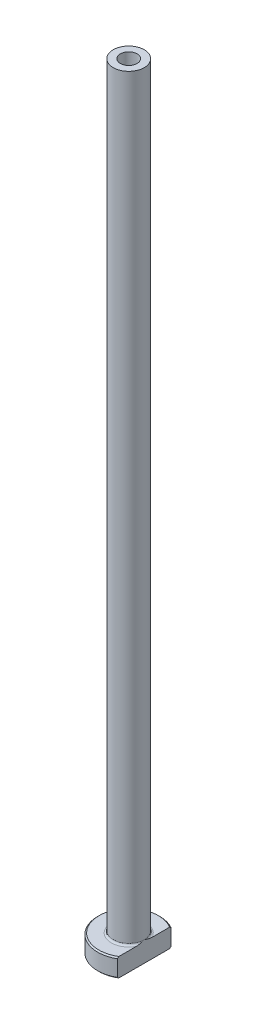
ISO-10303-21;
HEADER;
FILE_DESCRIPTION(('STEP AP214'),'2;1');
FILE_NAME('part.step','',(''),(''),'','','');
FILE_SCHEMA(('AUTOMOTIVE_DESIGN { 1 0 10303 214 1 1 1 1 }'));
ENDSEC;
DATA;
#1=APPLICATION_CONTEXT('core data for automotive mechanical design processes');
#2=APPLICATION_PROTOCOL_DEFINITION('international standard','automotive_design',2000,#1);
#3=PRODUCT_CONTEXT('',#1,'mechanical');
#4=PRODUCT('Part','Part','',(#3));
#5=PRODUCT_RELATED_PRODUCT_CATEGORY('part','',(#4));
#6=PRODUCT_DEFINITION_FORMATION('','',#4);
#7=PRODUCT_DEFINITION_CONTEXT('part definition',#1,'design');
#8=PRODUCT_DEFINITION('design','',#6,#7);
#9=PRODUCT_DEFINITION_SHAPE('','',#8);
#10=(LENGTH_UNIT() NAMED_UNIT(*) SI_UNIT(.MILLI.,.METRE.));
#11=(NAMED_UNIT(*) PLANE_ANGLE_UNIT() SI_UNIT($,.RADIAN.));
#12=(NAMED_UNIT(*) SI_UNIT($,.STERADIAN.) SOLID_ANGLE_UNIT());
#13=UNCERTAINTY_MEASURE_WITH_UNIT(LENGTH_MEASURE(1.E-05),#10,'distance_accuracy_value','');
#14=(GEOMETRIC_REPRESENTATION_CONTEXT(3) GLOBAL_UNCERTAINTY_ASSIGNED_CONTEXT((#13)) GLOBAL_UNIT_ASSIGNED_CONTEXT((#10,
#11,#12)) REPRESENTATION_CONTEXT('',''));
#15=CARTESIAN_POINT('',(0.,0.,0.));
#16=DIRECTION('',(0.,0.,1.));
#17=DIRECTION('',(1.,0.,0.));
#18=AXIS2_PLACEMENT_3D('',#15,#16,#17);
#19=CARTESIAN_POINT('',(0.,92.1876809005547,0.));
#20=DIRECTION('',(0.,1.,0.));
#21=DIRECTION('',(0.,0.,1.));
#22=AXIS2_PLACEMENT_3D('',#19,#20,#21);
#23=CYLINDRICAL_SURFACE('',#22,1.35);
#24=CARTESIAN_POINT('',(0.,125.,0.));
#25=DIRECTION('',(0.,1.,0.));
#26=DIRECTION('',(0.,0.,1.));
#27=AXIS2_PLACEMENT_3D('',#24,#25,#26);
#28=CIRCLE('',#27,1.35);
#29=CARTESIAN_POINT('',(0.,125.,1.35));
#30=VERTEX_POINT('',#29);
#31=EDGE_CURVE('E167',#30,#30,#28,.T.);
#32=ORIENTED_EDGE('',*,*,#31,.T.);
#33=EDGE_LOOP('',(#32));
#34=FACE_BOUND('',#33,.T.);
#35=CARTESIAN_POINT('',(0.,80.,0.));
#36=DIRECTION('',(0.,1.,0.));
#37=DIRECTION('',(0.,0.,1.));
#38=AXIS2_PLACEMENT_3D('',#35,#36,#37);
#39=CIRCLE('',#38,1.35);
#40=CARTESIAN_POINT('',(0.,80.,1.35));
#41=VERTEX_POINT('',#40);
#42=EDGE_CURVE('E170',#41,#41,#39,.T.);
#43=ORIENTED_EDGE('',*,*,#42,.F.);
#44=EDGE_LOOP('',(#43));
#45=FACE_BOUND('',#44,.T.);
#46=ADVANCED_FACE('F32',(#34,#45),#23,.F.);
#47=CARTESIAN_POINT('',(-1.35,125.,0.));
#48=DIRECTION('',(0.,1.,0.));
#49=DIRECTION('',(0.,0.,1.));
#50=AXIS2_PLACEMENT_3D('',#47,#48,#49);
#51=PLANE('',#50);
#52=CARTESIAN_POINT('',(0.,125.,0.));
#53=DIRECTION('',(0.,1.,0.));
#54=DIRECTION('',(0.,0.,1.));
#55=AXIS2_PLACEMENT_3D('',#52,#53,#54);
#56=CIRCLE('',#55,2.5);
#57=CARTESIAN_POINT('',(0.,125.,2.5));
#58=VERTEX_POINT('',#57);
#59=EDGE_CURVE('E174',#58,#58,#56,.T.);
#60=ORIENTED_EDGE('',*,*,#59,.T.);
#61=EDGE_LOOP('',(#60));
#62=FACE_BOUND('',#61,.T.);
#63=ORIENTED_EDGE('',*,*,#31,.F.);
#64=EDGE_LOOP('',(#63));
#65=FACE_BOUND('',#64,.T.);
#66=ADVANCED_FACE('F157',(#62,#65),#51,.T.);
#67=CARTESIAN_POINT('',(0.,92.1876809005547,0.));
#68=DIRECTION('',(0.,1.,0.));
#69=DIRECTION('',(0.,0.,1.));
#70=AXIS2_PLACEMENT_3D('',#67,#68,#69);
#71=CYLINDRICAL_SURFACE('',#70,2.5);
#72=CARTESIAN_POINT('',(0.,3.3,0.));
#73=DIRECTION('',(0.,1.,0.));
#74=DIRECTION('',(0.,0.,1.));
#75=AXIS2_PLACEMENT_3D('',#72,#73,#74);
#76=CIRCLE('',#75,2.5);
#77=CARTESIAN_POINT('',(2.5,3.3,0.));
#78=VERTEX_POINT('',#77);
#79=EDGE_CURVE('E180',#78,#78,#76,.T.);
#80=ORIENTED_EDGE('',*,*,#79,.T.);
#81=EDGE_LOOP('',(#80));
#82=FACE_BOUND('',#81,.T.);
#83=ORIENTED_EDGE('',*,*,#59,.F.);
#84=EDGE_LOOP('',(#83));
#85=FACE_BOUND('',#84,.T.);
#86=ADVANCED_FACE('F162',(#82,#85),#71,.T.);
#87=CARTESIAN_POINT('',(-2.49999999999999,3.,0.));
#88=DIRECTION('',(0.,1.,0.));
#89=DIRECTION('',(0.,0.,1.));
#90=AXIS2_PLACEMENT_3D('',#87,#88,#89);
#91=PLANE('',#90);
#92=DIRECTION('',(0.,0.,1.));
#93=VECTOR('',#92,1.);
#94=CARTESIAN_POINT('',(2.49999999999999,3.,0.));
#95=LINE('',#94,#93);
#96=CARTESIAN_POINT('',(2.5,3.,-4.0975602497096));
#97=VERTEX_POINT('',#96);
#98=CARTESIAN_POINT('',(2.49999999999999,3.,-1.26095202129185));
#99=VERTEX_POINT('',#98);
#100=EDGE_CURVE('E54',#97,#99,#95,.T.);
#101=ORIENTED_EDGE('',*,*,#100,.F.);
#102=CARTESIAN_POINT('',(0.,3.,0.));
#103=DIRECTION('',(0.,1.,0.));
#104=DIRECTION('',(0.,0.,1.));
#105=AXIS2_PLACEMENT_3D('',#102,#103,#104);
#106=CIRCLE('',#105,4.80000000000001);
#107=CARTESIAN_POINT('',(2.49999999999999,3.,4.0975602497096));
#108=VERTEX_POINT('',#107);
#109=EDGE_CURVE('E186',#97,#108,#106,.T.);
#110=ORIENTED_EDGE('',*,*,#109,.T.);
#111=CARTESIAN_POINT('',(2.49999999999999,3.,1.26095202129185));
#112=VERTEX_POINT('',#111);
#113=EDGE_CURVE('E134',#112,#108,#95,.T.);
#114=ORIENTED_EDGE('',*,*,#113,.F.);
#115=CARTESIAN_POINT('',(0.,3.,0.));
#116=DIRECTION('',(0.,1.,0.));
#117=DIRECTION('',(0.,0.,1.));
#118=AXIS2_PLACEMENT_3D('',#115,#116,#117);
#119=CIRCLE('',#118,2.8);
#120=EDGE_CURVE('E183',#112,#99,#119,.F.);
#121=ORIENTED_EDGE('',*,*,#120,.T.);
#122=EDGE_LOOP('',(#101,#110,#114,#121));
#123=FACE_BOUND('',#122,.T.);
#124=ADVANCED_FACE('F197',(#123),#91,.T.);
#125=CARTESIAN_POINT('',(0.,92.1876809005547,0.));
#126=DIRECTION('',(0.,1.,0.));
#127=DIRECTION('',(0.,0.,1.));
#128=AXIS2_PLACEMENT_3D('',#125,#126,#127);
#129=CYLINDRICAL_SURFACE('',#128,4.99999999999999);
#130=DIRECTION('',(0.,-1.,0.));
#131=VECTOR('',#130,1.);
#132=CARTESIAN_POINT('',(2.49999999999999,125.,4.33012701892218));
#133=LINE('',#132,#131);
#134=CARTESIAN_POINT('',(2.49999999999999,2.80000000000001,4.33012701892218));
#135=VERTEX_POINT('',#134);
#136=CARTESIAN_POINT('',(2.49999999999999,0.200000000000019,4.33012701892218));
#137=VERTEX_POINT('',#136);
#138=EDGE_CURVE('E82',#135,#137,#133,.T.);
#139=ORIENTED_EDGE('',*,*,#138,.F.);
#140=CARTESIAN_POINT('',(0.,2.80000000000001,0.));
#141=DIRECTION('',(0.,1.,0.));
#142=DIRECTION('',(0.,0.,1.));
#143=AXIS2_PLACEMENT_3D('',#140,#141,#142);
#144=CIRCLE('',#143,4.99999999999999);
#145=CARTESIAN_POINT('',(2.5,2.80000000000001,-4.33012701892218));
#146=VERTEX_POINT('',#145);
#147=EDGE_CURVE('E95',#135,#146,#144,.F.);
#148=ORIENTED_EDGE('',*,*,#147,.T.);
#149=DIRECTION('',(0.,-1.,0.));
#150=VECTOR('',#149,1.);
#151=CARTESIAN_POINT('',(2.5,125.,-4.33012701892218));
#152=LINE('',#151,#150);
#153=CARTESIAN_POINT('',(2.5,0.20000000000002,-4.33012701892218));
#154=VERTEX_POINT('',#153);
#155=EDGE_CURVE('E192',#146,#154,#152,.T.);
#156=ORIENTED_EDGE('',*,*,#155,.T.);
#157=CARTESIAN_POINT('',(0.,0.20000000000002,0.));
#158=DIRECTION('',(0.,-1.,0.));
#159=DIRECTION('',(0.,0.,-1.));
#160=AXIS2_PLACEMENT_3D('',#157,#158,#159);
#161=CIRCLE('',#160,4.99999999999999);
#162=EDGE_CURVE('E98',#154,#137,#161,.F.);
#163=ORIENTED_EDGE('',*,*,#162,.T.);
#164=EDGE_LOOP('',(#139,#148,#156,#163));
#165=FACE_BOUND('',#164,.T.);
#166=ADVANCED_FACE('F190',(#165),#129,.T.);
#167=CARTESIAN_POINT('',(-4.99999999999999,0.,0.));
#168=DIRECTION('',(0.,-1.,0.));
#169=DIRECTION('',(0.,0.,-1.));
#170=AXIS2_PLACEMENT_3D('',#167,#168,#169);
#171=PLANE('',#170);
#172=CARTESIAN_POINT('',(0.,0.,0.));
#173=DIRECTION('',(0.,-1.,0.));
#174=DIRECTION('',(0.,0.,-1.));
#175=AXIS2_PLACEMENT_3D('',#172,#173,#174);
#176=CIRCLE('',#175,2.09999999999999);
#177=CARTESIAN_POINT('',(0.,0.,-2.09999999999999));
#178=VERTEX_POINT('',#177);
#179=EDGE_CURVE('E40',#178,#178,#176,.F.);
#180=ORIENTED_EDGE('',*,*,#179,.T.);
#181=EDGE_LOOP('',(#180));
#182=FACE_BOUND('',#181,.T.);
#183=DIRECTION('',(0.,0.,-1.));
#184=VECTOR('',#183,1.);
#185=CARTESIAN_POINT('',(2.49999999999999,0.,4.33012701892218));
#186=LINE('',#185,#184);
#187=CARTESIAN_POINT('',(2.49999999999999,0.,4.09756024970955));
#188=VERTEX_POINT('',#187);
#189=CARTESIAN_POINT('',(2.5,0.,-4.09756024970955));
#190=VERTEX_POINT('',#189);
#191=EDGE_CURVE('E47',#188,#190,#186,.T.);
#192=ORIENTED_EDGE('',*,*,#191,.F.);
#193=CARTESIAN_POINT('',(0.,0.,0.));
#194=DIRECTION('',(0.,-1.,0.));
#195=DIRECTION('',(0.,0.,-1.));
#196=AXIS2_PLACEMENT_3D('',#193,#194,#195);
#197=CIRCLE('',#196,4.79999999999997);
#198=EDGE_CURVE('E92',#188,#190,#197,.T.);
#199=ORIENTED_EDGE('',*,*,#198,.T.);
#200=EDGE_LOOP('',(#192,#199));
#201=FACE_BOUND('',#200,.T.);
#202=ADVANCED_FACE('F91',(#182,#201),#171,.T.);
#203=CARTESIAN_POINT('',(0.,92.1876809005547,0.));
#204=DIRECTION('',(0.,1.,0.));
#205=DIRECTION('',(0.,0.,1.));
#206=AXIS2_PLACEMENT_3D('',#203,#204,#205);
#207=CYLINDRICAL_SURFACE('',#206,1.59999999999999);
#208=CARTESIAN_POINT('',(0.,0.499999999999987,0.));
#209=DIRECTION('',(0.,-1.,0.));
#210=DIRECTION('',(0.,0.,-1.));
#211=AXIS2_PLACEMENT_3D('',#208,#209,#210);
#212=CIRCLE('',#211,1.59999999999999);
#213=CARTESIAN_POINT('',(0.,0.499999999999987,-1.59999999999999));
#214=VERTEX_POINT('',#213);
#215=EDGE_CURVE('E11',#214,#214,#212,.T.);
#216=ORIENTED_EDGE('',*,*,#215,.T.);
#217=EDGE_LOOP('',(#216));
#218=FACE_BOUND('',#217,.T.);
#219=CARTESIAN_POINT('',(0.,68.,0.));
#220=DIRECTION('',(0.,1.,0.));
#221=DIRECTION('',(0.,0.,1.));
#222=AXIS2_PLACEMENT_3D('',#219,#220,#221);
#223=CIRCLE('',#222,1.6);
#224=CARTESIAN_POINT('',(0.,68.,1.6));
#225=VERTEX_POINT('',#224);
#226=EDGE_CURVE('E172',#225,#225,#223,.T.);
#227=ORIENTED_EDGE('',*,*,#226,.T.);
#228=EDGE_LOOP('',(#227));
#229=FACE_BOUND('',#228,.T.);
#230=ADVANCED_FACE('F215',(#218,#229),#207,.F.);
#231=CARTESIAN_POINT('',(0.,68.,0.));
#232=DIRECTION('',(0.,-1.,0.));
#233=DIRECTION('',(0.,0.,-1.));
#234=AXIS2_PLACEMENT_3D('',#231,#232,#233);
#235=CONICAL_SURFACE('',#234,1.6,0.0208303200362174);
#236=ORIENTED_EDGE('',*,*,#42,.T.);
#237=EDGE_LOOP('',(#236));
#238=FACE_BOUND('',#237,.T.);
#239=ORIENTED_EDGE('',*,*,#226,.F.);
#240=EDGE_LOOP('',(#239));
#241=FACE_BOUND('',#240,.T.);
#242=ADVANCED_FACE('F111',(#238,#241),#235,.F.);
#243=CARTESIAN_POINT('',(0.,3.3,0.));
#244=DIRECTION('',(0.,1.,0.));
#245=DIRECTION('',(0.,0.,1.));
#246=AXIS2_PLACEMENT_3D('',#243,#244,#245);
#247=TOROIDAL_SURFACE('',#246,2.8,0.3);
#248=ORIENTED_EDGE('',*,*,#120,.F.);
#249=CARTESIAN_POINT('',(2.5,3.3,0.));
#250=CARTESIAN_POINT('',(2.5,3.3000006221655,-4.84263612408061E-11));
#251=CARTESIAN_POINT('',(2.5,3.30000124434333,1.59620985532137E-07));
#252=CARTESIAN_POINT('',(2.5,3.30000243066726,6.45477798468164E-07));
#253=CARTESIAN_POINT('',(2.5,3.30000299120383,9.78480493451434E-07));
#254=CARTESIAN_POINT('',(2.5,3.30000411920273,1.77471950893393E-06));
#255=CARTESIAN_POINT('',(2.5,3.30000467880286,2.24902109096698E-06));
#256=CARTESIAN_POINT('',(2.5,3.30000572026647,3.25953640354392E-06));
#257=CARTESIAN_POINT('',(2.5,3.30000620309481,3.79480702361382E-06));
#258=CARTESIAN_POINT('',(2.5,3.30000787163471,5.75794575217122E-06));
#259=CARTESIAN_POINT('',(2.5,3.30000896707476,7.26424053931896E-06));
#260=CARTESIAN_POINT('',(2.5,3.30001087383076,1.03361123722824E-05));
#261=CARTESIAN_POINT('',(2.5,3.30001169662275,1.18949493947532E-05));
#262=CARTESIAN_POINT('',(2.5,3.30001489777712,1.81400843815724E-05));
#263=CARTESIAN_POINT('',(2.5,3.30001712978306,2.29062168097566E-05));
#264=CARTESIAN_POINT('',(2.5,3.30002067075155,3.21793855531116E-05));
#265=CARTESIAN_POINT('',(2.5,3.30002205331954,3.66588977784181E-05));
#266=CARTESIAN_POINT('',(2.5,3.30002810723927,5.61718387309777E-05));
#267=CARTESIAN_POINT('',(2.5,3.30003284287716,7.11735842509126E-05));
#268=CARTESIAN_POINT('',(2.5,3.30004025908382,9.89920300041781E-05));
#269=CARTESIAN_POINT('',(2.5,3.30004315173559,0.000111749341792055));
#270=CARTESIAN_POINT('',(2.5,3.30006652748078,0.000206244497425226));
#271=CARTESIAN_POINT('',(2.5,3.3000969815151,0.000285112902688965));
#272=CARTESIAN_POINT('',(2.49999999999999,3.3002121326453,0.000594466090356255));
#273=CARTESIAN_POINT('',(2.5,3.30028938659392,0.000826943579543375));
#274=CARTESIAN_POINT('',(2.5,3.30059681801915,0.00173885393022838));
#275=CARTESIAN_POINT('',(2.5,3.30083479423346,0.00241625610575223));
#276=CARTESIAN_POINT('',(2.49999999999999,3.30181198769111,0.00521069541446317));
#277=CARTESIAN_POINT('',(2.49999999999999,3.30254240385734,0.00732996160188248));
#278=CARTESIAN_POINT('',(2.5,3.3122604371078,0.0355096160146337));
#279=CARTESIAN_POINT('',(2.5,3.32130808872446,0.0615551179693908));
#280=CARTESIAN_POINT('',(2.49999999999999,3.33896212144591,0.112677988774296));
#281=CARTESIAN_POINT('',(2.49999999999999,3.3475721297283,0.137754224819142));
#282=CARTESIAN_POINT('',(2.5,3.36573068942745,0.190981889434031));
#283=CARTESIAN_POINT('',(2.5,3.37526654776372,0.219137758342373));
#284=CARTESIAN_POINT('',(2.5,3.39422867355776,0.27581610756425));
#285=CARTESIAN_POINT('',(2.5,3.40365272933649,0.304339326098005));
#286=CARTESIAN_POINT('',(2.5,3.42641697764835,0.374416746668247));
#287=CARTESIAN_POINT('',(2.5,3.43959811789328,0.416023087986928));
#288=CARTESIAN_POINT('',(2.5,3.46479157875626,0.498481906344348));
#289=CARTESIAN_POINT('',(2.5,3.47682455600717,0.539328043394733));
#290=CARTESIAN_POINT('',(2.5,3.50224427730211,0.629981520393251));
#291=CARTESIAN_POINT('',(2.5,3.51538048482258,0.679860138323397));
#292=CARTESIAN_POINT('',(2.5,3.5396407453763,0.780511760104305));
#293=CARTESIAN_POINT('',(2.5,3.55074877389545,0.831288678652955));
#294=CARTESIAN_POINT('',(2.5,3.57087054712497,0.937063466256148));
#295=CARTESIAN_POINT('',(2.5,3.57967623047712,0.992102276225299));
#296=CARTESIAN_POINT('',(2.5,3.59301148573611,1.10256024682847));
#297=CARTESIAN_POINT('',(2.5,3.59755297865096,1.15797790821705));
#298=CARTESIAN_POINT('',(2.5,3.60093314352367,1.26786705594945));
#299=CARTESIAN_POINT('',(2.5,3.5998936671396,1.32233291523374));
#300=CARTESIAN_POINT('',(2.5,3.59277279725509,1.40310062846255));
#301=CARTESIAN_POINT('',(2.5,3.58952137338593,1.42965222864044));
#302=CARTESIAN_POINT('',(2.5,3.58085857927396,1.48239078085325));
#303=CARTESIAN_POINT('',(2.5,3.57544928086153,1.50857805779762));
#304=CARTESIAN_POINT('',(2.5,3.56298810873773,1.55658799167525));
#305=CARTESIAN_POINT('',(2.5,3.55628200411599,1.57849902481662));
#306=CARTESIAN_POINT('',(2.5,3.54055393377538,1.62160292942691));
#307=CARTESIAN_POINT('',(2.5,3.53152220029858,1.64279233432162));
#308=CARTESIAN_POINT('',(2.5,3.51057199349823,1.68404469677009));
#309=CARTESIAN_POINT('',(2.5,3.49862012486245,1.70409105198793));
#310=CARTESIAN_POINT('',(2.5,3.47134074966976,1.74172093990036));
#311=CARTESIAN_POINT('',(2.5,3.45603127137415,1.75931683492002));
#312=CARTESIAN_POINT('',(2.5,3.42979930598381,1.78297070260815));
#313=CARTESIAN_POINT('',(2.5,3.42024268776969,1.79054141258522));
#314=CARTESIAN_POINT('',(2.5,3.40009035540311,1.80416997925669));
#315=CARTESIAN_POINT('',(2.5,3.38949499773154,1.81022835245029));
#316=CARTESIAN_POINT('',(2.5,3.36727740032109,1.82047087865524));
#317=CARTESIAN_POINT('',(2.5,3.35564531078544,1.8246340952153));
#318=CARTESIAN_POINT('',(2.5,3.33178837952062,1.83058442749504));
#319=CARTESIAN_POINT('',(2.5,3.31956435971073,1.83237474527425));
#320=CARTESIAN_POINT('',(2.5,3.2966573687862,1.83331852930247));
#321=CARTESIAN_POINT('',(2.5,3.28598670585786,1.8327923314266));
#322=CARTESIAN_POINT('',(2.5,3.26490749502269,1.82986307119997));
#323=CARTESIAN_POINT('',(2.5,3.25449899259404,1.82745968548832));
#324=CARTESIAN_POINT('',(2.5,3.23467098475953,1.82111257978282));
#325=CARTESIAN_POINT('',(2.5,3.22522816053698,1.81724026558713));
#326=CARTESIAN_POINT('',(2.5,3.20699535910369,1.80819497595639));
#327=CARTESIAN_POINT('',(2.5,3.19820556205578,1.80302164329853));
#328=CARTESIAN_POINT('',(2.5,3.17663162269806,1.78842115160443));
#329=CARTESIAN_POINT('',(2.5,3.16436228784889,1.77823293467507));
#330=CARTESIAN_POINT('',(2.5,3.14157828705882,1.75604629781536));
#331=CARTESIAN_POINT('',(2.5,3.1310690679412,1.74404246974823));
#332=CARTESIAN_POINT('',(2.5,3.10600520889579,1.71142114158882));
#333=CARTESIAN_POINT('',(2.5,3.0926747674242,1.68986887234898));
#334=CARTESIAN_POINT('',(2.5,3.06940323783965,1.6450857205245));
#335=CARTESIAN_POINT('',(2.5,3.05946314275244,1.6218543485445));
#336=CARTESIAN_POINT('',(2.5,3.03545750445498,1.55546754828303));
#337=CARTESIAN_POINT('',(2.5,3.02444022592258,1.51122187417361));
#338=CARTESIAN_POINT('',(2.5,3.00863926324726,1.42119777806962));
#339=CARTESIAN_POINT('',(2.5,3.00393876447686,1.37540689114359));
#340=CARTESIAN_POINT('',(2.5,2.99924212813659,1.28072198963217));
#341=CARTESIAN_POINT('',(2.5,2.99956098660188,1.23181420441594));
#342=CARTESIAN_POINT('',(2.5,3.00436098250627,1.13410944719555));
#343=CARTESIAN_POINT('',(2.5,3.00885327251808,1.08531312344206));
#344=CARTESIAN_POINT('',(2.5,3.02074191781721,0.990773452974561));
#345=CARTESIAN_POINT('',(2.5,3.02796792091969,0.945007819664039));
#346=CARTESIAN_POINT('',(2.5,3.04465555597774,0.854199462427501));
#347=CARTESIAN_POINT('',(2.5,3.05410250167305,0.809153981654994));
#348=CARTESIAN_POINT('',(2.5,3.07710029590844,0.709411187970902));
#349=CARTESIAN_POINT('',(2.5,3.09109633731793,0.654817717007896));
#350=CARTESIAN_POINT('',(2.5,3.12140740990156,0.54486362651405));
#351=CARTESIAN_POINT('',(2.49999999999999,3.13777040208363,0.489516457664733));
#352=CARTESIAN_POINT('',(2.5,3.16649540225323,0.396740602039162));
#353=CARTESIAN_POINT('',(2.5,3.17848130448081,0.359193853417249));
#354=CARTESIAN_POINT('',(2.49999999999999,3.20280507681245,0.284651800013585));
#355=CARTESIAN_POINT('',(2.49999999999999,3.21513791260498,0.247654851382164));
#356=CARTESIAN_POINT('',(2.5,3.23873713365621,0.177767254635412));
#357=CARTESIAN_POINT('',(2.5,3.24997409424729,0.14486648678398));
#358=CARTESIAN_POINT('',(2.49999999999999,3.2730714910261,0.0777985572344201));
#359=CARTESIAN_POINT('',(2.49999999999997,3.28493883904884,0.0436336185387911));
#360=CARTESIAN_POINT('',(2.5,3.29745794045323,0.00732879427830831));
#361=CARTESIAN_POINT('',(2.5,3.29818879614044,0.00520838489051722));
#362=CARTESIAN_POINT('',(2.49999999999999,3.29916610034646,0.0024136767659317));
#363=CARTESIAN_POINT('',(2.49999999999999,3.29940376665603,0.00173715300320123));
#364=CARTESIAN_POINT('',(2.5,3.29971082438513,0.000826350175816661));
#365=CARTESIAN_POINT('',(2.5,3.29978800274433,0.000594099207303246));
#366=CARTESIAN_POINT('',(2.49999999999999,3.29990305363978,0.000285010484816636));
#367=CARTESIAN_POINT('',(2.49999999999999,3.29993349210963,0.000206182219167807));
#368=CARTESIAN_POINT('',(2.5,3.29995685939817,0.000111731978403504));
#369=CARTESIAN_POINT('',(2.5,3.29995975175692,9.89774288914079E-05));
#370=CARTESIAN_POINT('',(2.5,3.29996716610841,7.11651854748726E-05));
#371=CARTESIAN_POINT('',(2.5,3.29997189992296,5.61668073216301E-05));
#372=CARTESIAN_POINT('',(2.5,3.29997795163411,3.66576312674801E-05));
#373=CARTESIAN_POINT('',(2.5,3.29997933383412,3.21785228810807E-05));
#374=CARTESIAN_POINT('',(2.5,3.29998287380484,2.29061360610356E-05));
#375=CARTESIAN_POINT('',(2.5,3.29998510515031,1.81403649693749E-05));
#376=CARTESIAN_POINT('',(2.5,3.29998830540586,1.18955814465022E-05));
#377=CARTESIAN_POINT('',(2.5,3.2999891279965,1.03367753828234E-05));
#378=CARTESIAN_POINT('',(2.5,3.2999910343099,7.26492708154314E-06));
#379=CARTESIAN_POINT('',(2.5,3.29999212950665,5.7586221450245E-06));
#380=CARTESIAN_POINT('',(2.5,3.29999379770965,3.79542417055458E-06));
#381=CARTESIAN_POINT('',(2.5,3.29999428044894,3.26012711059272E-06));
#382=CARTESIAN_POINT('',(2.5,3.29999532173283,2.24954289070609E-06));
#383=CARTESIAN_POINT('',(2.5,3.29999588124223,1.77519856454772E-06));
#384=CARTESIAN_POINT('',(2.5,3.29999700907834,9.78856825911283E-07));
#385=CARTESIAN_POINT('',(2.5,3.29999756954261,6.4579684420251E-07));
#386=CARTESIAN_POINT('',(2.5,3.29999875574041,1.59799520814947E-07));
#387=CARTESIAN_POINT('',(2.5,3.29999937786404,4.84245626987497E-11));
#388=CARTESIAN_POINT('',(2.5,3.3,0.));
#389=B_SPLINE_CURVE_WITH_KNOTS('',3,(#249,#250,#251,#252,#253,#254,#255,#256,#257,#258,#259,
#260,#261,#262,#263,#264,#265,#266,#267,#268,#269,#270,#271,#272,#273,#274,#275,#276,#277,#278,
#279,#280,#281,#282,#283,#284,#285,#286,#287,#288,#289,#290,#291,#292,#293,#294,#295,#296,#297,
#298,#299,#300,#301,#302,#303,#304,#305,#306,#307,#308,#309,#310,#311,#312,#313,#314,#315,#316,
#317,#318,#319,#320,#321,#322,#323,#324,#325,#326,#327,#328,#329,#330,#331,#332,#333,#334,#335,
#336,#337,#338,#339,#340,#341,#342,#343,#344,#345,#346,#347,#348,#349,#350,#351,#352,#353,#354,
#355,#356,#357,#358,#359,#360,#361,#362,#363,#364,#365,#366,#367,#368,#369,#370,#371,#372,#373,
#374,#375,#376,#377,#378,#379,#380,#381,#382,#383,#384,#385,#386,#387,#388),.UNSPECIFIED.,.T.,
.F.,(4,2,2,2,2,2,2,2,2,2,2,2,2,2,2,2,2,2,2,2,2,2,2,2,2,2,2,2,2,2,2,2,2,2,2,2,2,2,2,2,2,2,2,2,2,
2,2,2,2,2,2,2,2,2,2,2,2,2,2,2,2,2,2,2,2,2,2,2,2,4),(0.,1.86789298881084E-06,
3.81549735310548E-06,6.00610634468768E-06,8.16653176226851E-06,1.37285614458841E-05,
1.90122201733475E-05,3.47597321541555E-05,4.88082658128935E-05,9.59978477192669E-05,
0.000135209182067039,0.000388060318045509,0.00112364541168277,0.00327678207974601,
0.0100024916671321,0.0927120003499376,0.172253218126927,0.261432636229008,0.351551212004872,
0.482477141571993,0.610212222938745,0.764915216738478,0.920792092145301,1.0878789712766,
1.25449733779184,1.41749285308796,1.49767530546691,1.57778095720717,1.64642481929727,
1.71536183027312,1.78512750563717,1.85452737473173,1.89099315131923,1.92744645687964,
1.96429324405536,2.0010902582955,2.03297105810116,2.06485735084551,2.0953592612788,
2.12586955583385,2.17344034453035,2.22115572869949,2.29675134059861,2.37236907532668,
2.50839721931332,2.64619971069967,2.79268284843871,2.9395585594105,3.07848421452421,
3.21651583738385,3.38554045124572,3.55865938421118,3.67689643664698,3.79388863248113,
3.89819085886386,4.00668323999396,4.0134126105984,4.0155629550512,4.01629782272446,
4.0165505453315,4.0165897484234,4.01663692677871,4.01665097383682,4.01666671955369,
4.01667200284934,4.01667756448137,4.01667972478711,4.01668191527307,4.01668386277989,
4.01668573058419),.UNSPECIFIED.);
#390=EDGE_CURVE('E126',#112,#78,#389,.T.);
#391=ORIENTED_EDGE('',*,*,#390,.T.);
#392=ORIENTED_EDGE('',*,*,#79,.F.);
#393=CARTESIAN_POINT('',(2.5,3.3,0.));
#394=CARTESIAN_POINT('',(2.5,3.2999993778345,4.84268776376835E-11));
#395=CARTESIAN_POINT('',(2.5,3.29999875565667,-1.59620985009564E-07));
#396=CARTESIAN_POINT('',(2.5,3.29999756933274,-6.45477797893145E-07));
#397=CARTESIAN_POINT('',(2.5,3.29999700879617,-9.7848049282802E-07));
#398=CARTESIAN_POINT('',(2.5,3.29999588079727,-1.77471950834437E-06));
#399=CARTESIAN_POINT('',(2.5,3.29999532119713,-2.24902109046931E-06));
#400=CARTESIAN_POINT('',(2.5,3.29999427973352,-3.25953640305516E-06));
#401=CARTESIAN_POINT('',(2.5,3.29999379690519,-3.79480702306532E-06));
#402=CARTESIAN_POINT('',(2.5,3.29999212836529,-5.75794575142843E-06));
#403=CARTESIAN_POINT('',(2.5,3.29999103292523,-7.26424053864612E-06));
#404=CARTESIAN_POINT('',(2.5,3.29998912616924,-1.03361123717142E-05));
#405=CARTESIAN_POINT('',(2.5,3.29998830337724,-1.18949493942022E-05));
#406=CARTESIAN_POINT('',(2.5,3.29998510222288,-1.81400843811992E-05));
#407=CARTESIAN_POINT('',(2.5,3.29998287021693,-2.29062168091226E-05));
#408=CARTESIAN_POINT('',(2.5,3.29997932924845,-3.21793855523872E-05));
#409=CARTESIAN_POINT('',(2.5,3.29997794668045,-3.66588977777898E-05));
#410=CARTESIAN_POINT('',(2.5,3.29997189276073,-5.61718387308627E-05));
#411=CARTESIAN_POINT('',(2.5,3.29996715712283,-7.11735842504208E-05));
#412=CARTESIAN_POINT('',(2.5,3.29995974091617,-9.89920300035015E-05));
#413=CARTESIAN_POINT('',(2.5,3.2999568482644,-0.000111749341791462));
#414=CARTESIAN_POINT('',(2.5,3.29993347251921,-0.000206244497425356));
#415=CARTESIAN_POINT('',(2.5,3.2999030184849,-0.000285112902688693));
#416=CARTESIAN_POINT('',(2.49999999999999,3.29978786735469,-0.000594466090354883));
#417=CARTESIAN_POINT('',(2.5,3.29971061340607,-0.000826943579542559));
#418=CARTESIAN_POINT('',(2.5,3.29940318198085,-0.00173885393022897));
#419=CARTESIAN_POINT('',(2.5,3.29916520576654,-0.00241625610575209));
#420=CARTESIAN_POINT('',(2.49999999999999,3.29818801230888,-0.0052106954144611));
#421=CARTESIAN_POINT('',(2.49999999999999,3.29745759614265,-0.00732996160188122));
#422=CARTESIAN_POINT('',(2.5,3.28773956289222,-0.0355096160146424));
#423=CARTESIAN_POINT('',(2.5,3.27869191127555,-0.0615551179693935));
#424=CARTESIAN_POINT('',(2.49999999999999,3.26103787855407,-0.112677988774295));
#425=CARTESIAN_POINT('',(2.49999999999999,3.25242787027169,-0.137754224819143));
#426=CARTESIAN_POINT('',(2.5,3.23426931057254,-0.190981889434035));
#427=CARTESIAN_POINT('',(2.5,3.22473345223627,-0.219137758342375));
#428=CARTESIAN_POINT('',(2.5,3.20577132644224,-0.27581610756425));
#429=CARTESIAN_POINT('',(2.5,3.19634727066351,-0.304339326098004));
#430=CARTESIAN_POINT('',(2.5,3.17358302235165,-0.374416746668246));
#431=CARTESIAN_POINT('',(2.5,3.16040188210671,-0.416023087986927));
#432=CARTESIAN_POINT('',(2.5,3.13520842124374,-0.498481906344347));
#433=CARTESIAN_POINT('',(2.5,3.12317544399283,-0.539328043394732));
#434=CARTESIAN_POINT('',(2.5,3.09775572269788,-0.62998152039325));
#435=CARTESIAN_POINT('',(2.5,3.08461951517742,-0.679860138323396));
#436=CARTESIAN_POINT('',(2.5,3.06035925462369,-0.780511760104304));
#437=CARTESIAN_POINT('',(2.5,3.04925122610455,-0.831288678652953));
#438=CARTESIAN_POINT('',(2.5,3.02912945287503,-0.937063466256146));
#439=CARTESIAN_POINT('',(2.5,3.02032376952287,-0.992102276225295));
#440=CARTESIAN_POINT('',(2.5,3.00698851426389,-1.10256024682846));
#441=CARTESIAN_POINT('',(2.5,3.00244702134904,-1.15797790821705));
#442=CARTESIAN_POINT('',(2.5,2.99906685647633,-1.26786705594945));
#443=CARTESIAN_POINT('',(2.5,3.00010633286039,-1.32233291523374));
#444=CARTESIAN_POINT('',(2.5,3.0072272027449,-1.40310062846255));
#445=CARTESIAN_POINT('',(2.5,3.01047862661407,-1.42965222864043));
#446=CARTESIAN_POINT('',(2.5,3.01914142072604,-1.48239078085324));
#447=CARTESIAN_POINT('',(2.5,3.02455071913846,-1.50857805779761));
#448=CARTESIAN_POINT('',(2.5,3.03701189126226,-1.55658799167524));
#449=CARTESIAN_POINT('',(2.5,3.043717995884,-1.57849902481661));
#450=CARTESIAN_POINT('',(2.5,3.05944606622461,-1.6216029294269));
#451=CARTESIAN_POINT('',(2.5,3.06847779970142,-1.64279233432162));
#452=CARTESIAN_POINT('',(2.5,3.08942800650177,-1.68404469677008));
#453=CARTESIAN_POINT('',(2.5,3.10137987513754,-1.70409105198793));
#454=CARTESIAN_POINT('',(2.5,3.12865925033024,-1.74172093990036));
#455=CARTESIAN_POINT('',(2.5,3.14396872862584,-1.75931683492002));
#456=CARTESIAN_POINT('',(2.5,3.17020069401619,-1.78297070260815));
#457=CARTESIAN_POINT('',(2.5,3.17975731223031,-1.79054141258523));
#458=CARTESIAN_POINT('',(2.5,3.19990964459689,-1.80416997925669));
#459=CARTESIAN_POINT('',(2.5,3.21050500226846,-1.81022835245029));
#460=CARTESIAN_POINT('',(2.5,3.2327225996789,-1.82047087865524));
#461=CARTESIAN_POINT('',(2.5,3.24435468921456,-1.8246340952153));
#462=CARTESIAN_POINT('',(2.5,3.26821162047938,-1.83058442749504));
#463=CARTESIAN_POINT('',(2.5,3.28043564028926,-1.83237474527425));
#464=CARTESIAN_POINT('',(2.5,3.3033426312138,-1.83331852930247));
#465=CARTESIAN_POINT('',(2.5,3.31401329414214,-1.8327923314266));
#466=CARTESIAN_POINT('',(2.5,3.33509250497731,-1.82986307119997));
#467=CARTESIAN_POINT('',(2.5,3.34550100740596,-1.82745968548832));
#468=CARTESIAN_POINT('',(2.5,3.36532901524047,-1.82111257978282));
#469=CARTESIAN_POINT('',(2.5,3.37477183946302,-1.81724026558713));
#470=CARTESIAN_POINT('',(2.5,3.3930046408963,-1.80819497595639));
#471=CARTESIAN_POINT('',(2.5,3.40179443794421,-1.80302164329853));
#472=CARTESIAN_POINT('',(2.5,3.42336837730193,-1.78842115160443));
#473=CARTESIAN_POINT('',(2.5,3.43563771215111,-1.77823293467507));
#474=CARTESIAN_POINT('',(2.5,3.45842171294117,-1.75604629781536));
#475=CARTESIAN_POINT('',(2.5,3.4689309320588,-1.74404246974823));
#476=CARTESIAN_POINT('',(2.5,3.49399479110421,-1.71142114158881));
#477=CARTESIAN_POINT('',(2.5,3.5073252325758,-1.68986887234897));
#478=CARTESIAN_POINT('',(2.5,3.53059676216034,-1.6450857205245));
#479=CARTESIAN_POINT('',(2.5,3.54053685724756,-1.62185434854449));
#480=CARTESIAN_POINT('',(2.5,3.56454249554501,-1.55546754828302));
#481=CARTESIAN_POINT('',(2.5,3.57555977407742,-1.51122187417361));
#482=CARTESIAN_POINT('',(2.5,3.59136073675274,-1.42119777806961));
#483=CARTESIAN_POINT('',(2.5,3.59606123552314,-1.37540689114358));
#484=CARTESIAN_POINT('',(2.5,3.6007578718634,-1.28072198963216));
#485=CARTESIAN_POINT('',(2.5,3.60043901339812,-1.23181420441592));
#486=CARTESIAN_POINT('',(2.5,3.59563901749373,-1.13410944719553));
#487=CARTESIAN_POINT('',(2.5,3.59114672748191,-1.08531312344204));
#488=CARTESIAN_POINT('',(2.5,3.57925808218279,-0.990773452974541));
#489=CARTESIAN_POINT('',(2.5,3.5720320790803,-0.945007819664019));
#490=CARTESIAN_POINT('',(2.5,3.55534444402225,-0.854199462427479));
#491=CARTESIAN_POINT('',(2.5,3.54589749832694,-0.809153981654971));
#492=CARTESIAN_POINT('',(2.5,3.52289970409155,-0.70941118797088));
#493=CARTESIAN_POINT('',(2.5,3.50890366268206,-0.654817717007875));
#494=CARTESIAN_POINT('',(2.5,3.47859259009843,-0.544863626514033));
#495=CARTESIAN_POINT('',(2.49999999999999,3.46222959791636,-0.489516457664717));
#496=CARTESIAN_POINT('',(2.5,3.43350459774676,-0.396740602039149));
#497=CARTESIAN_POINT('',(2.5,3.42151869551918,-0.359193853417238));
#498=CARTESIAN_POINT('',(2.49999999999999,3.39719492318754,-0.284651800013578));
#499=CARTESIAN_POINT('',(2.49999999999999,3.38486208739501,-0.247654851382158));
#500=CARTESIAN_POINT('',(2.5,3.36126286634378,-0.177767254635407));
#501=CARTESIAN_POINT('',(2.5,3.3500259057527,-0.144866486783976));
#502=CARTESIAN_POINT('',(2.49999999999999,3.3269285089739,-0.0777985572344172));
#503=CARTESIAN_POINT('',(2.49999999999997,3.31506116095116,-0.0436336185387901));
#504=CARTESIAN_POINT('',(2.5,3.30254205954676,-0.00732879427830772));
#505=CARTESIAN_POINT('',(2.5,3.30181120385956,-0.00520838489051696));
#506=CARTESIAN_POINT('',(2.49999999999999,3.30083389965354,-0.00241367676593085));
#507=CARTESIAN_POINT('',(2.49999999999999,3.30059623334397,-0.00173715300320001));
#508=CARTESIAN_POINT('',(2.5,3.30028917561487,-0.000826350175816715));
#509=CARTESIAN_POINT('',(2.5,3.30021199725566,-0.000594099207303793));
#510=CARTESIAN_POINT('',(2.49999999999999,3.30009694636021,-0.000285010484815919));
#511=CARTESIAN_POINT('',(2.49999999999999,3.30006650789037,-0.000206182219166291));
#512=CARTESIAN_POINT('',(2.5,3.30004314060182,-0.000111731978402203));
#513=CARTESIAN_POINT('',(2.5,3.30004024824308,-9.89774288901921E-05));
#514=CARTESIAN_POINT('',(2.5,3.30003283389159,-7.11651854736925E-05));
#515=CARTESIAN_POINT('',(2.5,3.30002810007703,-5.61668073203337E-05));
#516=CARTESIAN_POINT('',(2.5,3.30002204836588,-3.66576312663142E-05));
#517=CARTESIAN_POINT('',(2.5,3.30002066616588,-3.21785228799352E-05));
#518=CARTESIAN_POINT('',(2.5,3.30001712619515,-2.29061360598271E-05));
#519=CARTESIAN_POINT('',(2.5,3.30001489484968,-1.81403649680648E-05));
#520=CARTESIAN_POINT('',(2.5,3.30001169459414,-1.18955814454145E-05));
#521=CARTESIAN_POINT('',(2.5,3.30001087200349,-1.0336775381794E-05));
#522=CARTESIAN_POINT('',(2.5,3.3000089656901,-7.2649270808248E-06));
#523=CARTESIAN_POINT('',(2.5,3.30000787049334,-5.75862214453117E-06));
#524=CARTESIAN_POINT('',(2.5,3.30000620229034,-3.79542417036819E-06));
#525=CARTESIAN_POINT('',(2.5,3.30000571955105,-3.26012711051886E-06));
#526=CARTESIAN_POINT('',(2.5,3.30000467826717,-2.24954289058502E-06));
#527=CARTESIAN_POINT('',(2.5,3.30000411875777,-1.77519856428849E-06));
#528=CARTESIAN_POINT('',(2.5,3.30000299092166,-9.78856825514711E-07));
#529=CARTESIAN_POINT('',(2.5,3.30000243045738,-6.45796843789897E-07));
#530=CARTESIAN_POINT('',(2.5,3.30000124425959,-1.59799520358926E-07));
#531=CARTESIAN_POINT('',(2.5,3.30000062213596,-4.84240775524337E-11));
#532=CARTESIAN_POINT('',(2.5,3.3,0.));
#533=B_SPLINE_CURVE_WITH_KNOTS('',3,(#393,#394,#395,#396,#397,#398,#399,#400,#401,#402,#403,
#404,#405,#406,#407,#408,#409,#410,#411,#412,#413,#414,#415,#416,#417,#418,#419,#420,#421,#422,
#423,#424,#425,#426,#427,#428,#429,#430,#431,#432,#433,#434,#435,#436,#437,#438,#439,#440,#441,
#442,#443,#444,#445,#446,#447,#448,#449,#450,#451,#452,#453,#454,#455,#456,#457,#458,#459,#460,
#461,#462,#463,#464,#465,#466,#467,#468,#469,#470,#471,#472,#473,#474,#475,#476,#477,#478,#479,
#480,#481,#482,#483,#484,#485,#486,#487,#488,#489,#490,#491,#492,#493,#494,#495,#496,#497,#498,
#499,#500,#501,#502,#503,#504,#505,#506,#507,#508,#509,#510,#511,#512,#513,#514,#515,#516,#517,
#518,#519,#520,#521,#522,#523,#524,#525,#526,#527,#528,#529,#530,#531,#532),.UNSPECIFIED.,.T.,
.F.,(4,2,2,2,2,2,2,2,2,2,2,2,2,2,2,2,2,2,2,2,2,2,2,2,2,2,2,2,2,2,2,2,2,2,2,2,2,2,2,2,2,2,2,2,2,
2,2,2,2,2,2,2,2,2,2,2,2,2,2,2,2,2,2,2,2,2,2,2,2,4),(0.,1.86789298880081E-06,
3.81549735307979E-06,6.00610634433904E-06,8.16653176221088E-06,1.37285614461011E-05,
1.90122201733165E-05,3.47597321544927E-05,4.88082658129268E-05,9.59978477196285E-05,
0.000135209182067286,0.000388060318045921,0.00112364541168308,0.00327678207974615,
0.0100024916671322,0.0927120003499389,0.172253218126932,0.26143263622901,0.351551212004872,
0.482477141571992,0.610212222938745,0.764915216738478,0.9207920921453,1.08787897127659,
1.25449733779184,1.41749285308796,1.4976753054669,1.57778095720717,1.64642481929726,
1.71536183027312,1.78512750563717,1.85452737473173,1.89099315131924,1.92744645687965,
1.96429324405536,2.00109025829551,2.03297105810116,2.06485735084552,2.0953592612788,
2.12586955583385,2.17344034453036,2.22115572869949,2.29675134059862,2.37236907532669,
2.50839721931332,2.64619971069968,2.79268284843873,2.93955855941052,3.07848421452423,
3.21651583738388,3.38554045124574,3.5586593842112,3.67689643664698,3.79388863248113,
3.89819085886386,4.00668323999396,4.0134126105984,4.0155629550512,4.01629782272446,
4.0165505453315,4.0165897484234,4.01663692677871,4.01665097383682,4.01666671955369,
4.01667200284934,4.01667756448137,4.0166797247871,4.01668191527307,4.01668386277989,
4.01668573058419),.UNSPECIFIED.);
#534=EDGE_CURVE('E135',#78,#99,#533,.T.);
#535=ORIENTED_EDGE('',*,*,#534,.T.);
#536=EDGE_LOOP('',(#248,#391,#392,#535));
#537=FACE_BOUND('',#536,.T.);
#538=ADVANCED_FACE('F141',(#537),#247,.F.);
#539=CARTESIAN_POINT('',(0.,3.,0.));
#540=DIRECTION('',(0.,-1.,0.));
#541=DIRECTION('',(0.,0.,-1.));
#542=AXIS2_PLACEMENT_3D('',#539,#540,#541);
#543=CONICAL_SURFACE('',#542,4.80000000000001,0.785398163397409);
#544=CARTESIAN_POINT('',(2.5,-2.05039133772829,-9.52786489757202));
#545=CARTESIAN_POINT('',(2.5,-1.84160367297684,-9.31199733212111));
#546=CARTESIAN_POINT('',(2.5,-1.63304008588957,-9.09591231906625));
#547=CARTESIAN_POINT('',(2.5,-1.21649358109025,-8.66317810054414));
#548=CARTESIAN_POINT('',(2.5,-1.0085106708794,-8.44652888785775));
#549=CARTESIAN_POINT('',(2.5,-0.593157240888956,-8.01243155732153));
#550=CARTESIAN_POINT('',(2.5,-0.385787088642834,-7.79498308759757));
#551=CARTESIAN_POINT('',(2.5,0.0280365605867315,-7.35921771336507));
#552=CARTESIAN_POINT('',(2.5,0.234490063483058,-7.14090081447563));
#553=CARTESIAN_POINT('',(2.5,0.642130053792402,-6.70748960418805));
#554=CARTESIAN_POINT('',(2.5,0.843339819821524,-6.49241720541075));
#555=CARTESIAN_POINT('',(2.5,1.24425381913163,-6.06087422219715));
#556=CARTESIAN_POINT('',(2.5,1.44395806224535,-5.84440364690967));
#557=CARTESIAN_POINT('',(2.5,1.84127751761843,-5.40963663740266));
#558=CARTESIAN_POINT('',(2.5,2.03889317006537,-5.19134060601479));
#559=CARTESIAN_POINT('',(2.5,2.4312504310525,-4.75218509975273));
#560=CARTESIAN_POINT('',(2.5,2.62599215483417,-4.53132572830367));
#561=CARTESIAN_POINT('',(2.5,2.93693788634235,-4.17181619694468));
#562=CARTESIAN_POINT('',(2.5,3.05446493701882,-4.03431188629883));
#563=CARTESIAN_POINT('',(2.5,3.28742704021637,-3.75751486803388));
#564=CARTESIAN_POINT('',(2.5,3.4028618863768,-3.6182219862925));
#565=CARTESIAN_POINT('',(2.5,3.63213234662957,-3.33586492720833));
#566=CARTESIAN_POINT('',(2.5,3.74593818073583,-3.19277645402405));
#567=CARTESIAN_POINT('',(2.5,3.96956266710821,-2.90356071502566));
#568=CARTESIAN_POINT('',(2.5,4.07938227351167,-2.75743418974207));
#569=CARTESIAN_POINT('',(2.5,4.29502410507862,-2.45881038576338));
#570=CARTESIAN_POINT('',(2.5,4.40076032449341,-2.30625006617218));
#571=CARTESIAN_POINT('',(2.5,4.55286945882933,-2.07299325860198));
#572=CARTESIAN_POINT('',(2.5,4.60252613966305,-1.99444197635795));
#573=CARTESIAN_POINT('',(2.5,4.69908164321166,-1.83566827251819));
#574=CARTESIAN_POINT('',(2.5,4.74598077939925,-1.75544604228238));
#575=CARTESIAN_POINT('',(2.5,4.8357846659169,-1.59405362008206));
#576=CARTESIAN_POINT('',(2.5,4.87873126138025,-1.51290702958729));
#577=CARTESIAN_POINT('',(2.5,4.96038600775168,-1.34852090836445));
#578=CARTESIAN_POINT('',(2.5,4.99909338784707,-1.26528100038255));
#579=CARTESIAN_POINT('',(2.5,5.10703093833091,-1.01251774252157));
#580=CARTESIAN_POINT('',(2.5,5.16843307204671,-0.839342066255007));
#581=CARTESIAN_POINT('',(2.5,5.23490554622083,-0.57970344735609));
#582=CARTESIAN_POINT('',(2.5,5.25253806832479,-0.496421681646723));
#583=CARTESIAN_POINT('',(2.5,5.27986337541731,-0.328535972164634));
#584=CARTESIAN_POINT('',(2.5,5.28955686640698,-0.24393214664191));
#585=CARTESIAN_POINT('',(2.5,5.30031768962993,-0.0744340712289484));
#586=CARTESIAN_POINT('',(2.5,5.30141176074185,0.0104584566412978));
#587=CARTESIAN_POINT('',(2.5,5.2949653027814,0.179916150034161));
#588=CARTESIAN_POINT('',(2.5,5.28742406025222,0.264481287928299));
#589=CARTESIAN_POINT('',(2.5,5.26433424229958,0.43175473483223));
#590=CARTESIAN_POINT('',(2.5,5.24885436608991,0.514472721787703));
#591=CARTESIAN_POINT('',(2.5,5.21085318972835,0.678257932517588));
#592=CARTESIAN_POINT('',(2.5,5.18833104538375,0.759324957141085));
#593=CARTESIAN_POINT('',(2.5,5.13718929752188,0.920001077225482));
#594=CARTESIAN_POINT('',(2.5,5.10853534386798,0.999599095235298));
#595=CARTESIAN_POINT('',(2.5,5.04628092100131,1.15679278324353));
#596=CARTESIAN_POINT('',(2.5,5.01268146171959,1.23438885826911));
#597=CARTESIAN_POINT('',(2.5,4.90558195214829,1.46503672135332));
#598=CARTESIAN_POINT('',(2.5,4.82601567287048,1.61526350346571));
#599=CARTESIAN_POINT('',(2.5,4.65635232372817,1.90970759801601));
#600=CARTESIAN_POINT('',(2.49999999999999,4.56624199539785,2.0539170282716));
#601=CARTESIAN_POINT('',(2.49999999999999,4.37862201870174,2.33821627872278));
#602=CARTESIAN_POINT('',(2.49999999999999,4.28108460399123,2.47828761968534));
#603=CARTESIAN_POINT('',(2.49999999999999,4.08116271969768,2.75478641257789));
#604=CARTESIAN_POINT('',(2.49999999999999,3.97878070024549,2.89121565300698));
#605=CARTESIAN_POINT('',(2.49999999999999,3.7691391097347,3.16313520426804));
#606=CARTESIAN_POINT('',(2.49999999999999,3.6618330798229,3.29858952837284));
#607=CARTESIAN_POINT('',(2.49999999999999,3.44456217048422,3.56736427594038));
#608=CARTESIAN_POINT('',(2.49999999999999,3.33459700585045,3.70068446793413));
#609=CARTESIAN_POINT('',(2.49999999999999,3.11293465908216,3.96532340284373));
#610=CARTESIAN_POINT('',(2.49999999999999,3.00124232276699,4.09664621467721));
#611=CARTESIAN_POINT('',(2.49999999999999,2.77631276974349,4.35796341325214));
#612=CARTESIAN_POINT('',(2.49999999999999,2.66307552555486,4.48795777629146));
#613=CARTESIAN_POINT('',(2.49999999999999,2.36028773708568,4.83228553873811));
#614=CARTESIAN_POINT('',(2.49999999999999,2.16967435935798,5.04568363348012));
#615=CARTESIAN_POINT('',(2.49999999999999,1.78611780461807,5.47037913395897));
#616=CARTESIAN_POINT('',(2.49999999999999,1.59317456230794,5.6816764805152));
#617=CARTESIAN_POINT('',(2.49999999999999,1.20540648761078,6.10290357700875));
#618=CARTESIAN_POINT('',(2.49999999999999,1.01058005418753,6.31283185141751));
#619=CARTESIAN_POINT('',(2.49999999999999,0.61964985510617,6.73149551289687));
#620=CARTESIAN_POINT('',(2.49999999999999,0.423546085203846,6.94023089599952));
#621=CARTESIAN_POINT('',(2.49999999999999,0.0384434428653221,7.34820392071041));
#622=CARTESIAN_POINT('',(2.49999999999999,-0.150515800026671,7.54747899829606));
#623=CARTESIAN_POINT('',(2.49999999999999,-0.529153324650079,7.94534601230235));
#624=CARTESIAN_POINT('',(2.49999999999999,-0.718831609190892,8.14393794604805));
#625=CARTESIAN_POINT('',(2.49999999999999,-1.09855461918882,8.54034636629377));
#626=CARTESIAN_POINT('',(2.49999999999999,-1.2885986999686,8.73816347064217));
#627=CARTESIAN_POINT('',(2.49999999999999,-1.66916268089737,9.13333639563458));
#628=CARTESIAN_POINT('',(2.49999999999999,-1.85968257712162,9.33069222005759));
#629=CARTESIAN_POINT('',(2.49999999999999,-2.05039133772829,9.52786489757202));
#630=B_SPLINE_CURVE_WITH_KNOTS('',3,(#544,#545,#546,#547,#548,#549,#550,#551,#552,#553,#554,
#555,#556,#557,#558,#559,#560,#561,#562,#563,#564,#565,#566,#567,#568,#569,#570,#571,#572,#573,
#574,#575,#576,#577,#578,#579,#580,#581,#582,#583,#584,#585,#586,#587,#588,#589,#590,#591,#592,
#593,#594,#595,#596,#597,#598,#599,#600,#601,#602,#603,#604,#605,#606,#607,#608,#609,#610,#611,
#612,#613,#614,#615,#616,#617,#618,#619,#620,#621,#622,#623,#624,#625,#626,#627,#628,#629),
.UNSPECIFIED.,.F.,.F.,(4,2,2,2,2,2,2,2,2,2,2,2,2,2,2,2,2,2,2,2,2,2,2,2,2,2,2,2,2,2,2,2,2,2,2,2,
2,2,2,2,2,2,4),(0.,0.900955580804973,1.80192274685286,2.70335062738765,3.60477268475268,
4.48832484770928,5.37187123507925,6.25522753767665,7.13854832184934,7.68119321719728,
8.22389134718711,8.7723229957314,9.32062249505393,9.87724663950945,10.155993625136,
10.4347088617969,10.7100145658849,10.98537024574,11.5339745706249,11.7890461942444,
12.0440951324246,12.2983507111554,12.5526272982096,12.8047396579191,13.0568822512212,
13.3104761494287,13.5640183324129,14.0732618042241,14.5831526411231,15.0950533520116,
15.6066978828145,16.1250759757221,16.6435099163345,17.1606868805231,17.6778730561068,
18.5362451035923,19.3946412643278,20.2538459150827,21.1130534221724,21.9369112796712,
22.7607723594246,23.5837145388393,24.4066499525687),.UNSPECIFIED.);
#631=EDGE_CURVE('E133',#146,#97,#630,.T.);
#632=ORIENTED_EDGE('',*,*,#631,.F.);
#633=ORIENTED_EDGE('',*,*,#147,.F.);
#634=EDGE_CURVE('E118',#108,#135,#630,.T.);
#635=ORIENTED_EDGE('',*,*,#634,.F.);
#636=ORIENTED_EDGE('',*,*,#109,.F.);
#637=EDGE_LOOP('',(#632,#633,#635,#636));
#638=FACE_BOUND('',#637,.T.);
#639=ADVANCED_FACE('F145',(#638),#543,.T.);
#640=CARTESIAN_POINT('',(0.,0.20000000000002,0.));
#641=DIRECTION('',(0.,1.,0.));
#642=DIRECTION('',(0.,0.,1.));
#643=AXIS2_PLACEMENT_3D('',#640,#641,#642);
#644=CONICAL_SURFACE('',#643,4.99999999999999,0.785398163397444);
#645=CARTESIAN_POINT('',(2.49999999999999,5.05039133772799,9.52786489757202));
#646=CARTESIAN_POINT('',(2.49999999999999,4.84160367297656,9.31199733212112));
#647=CARTESIAN_POINT('',(2.49999999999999,4.63304008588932,9.09591231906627));
#648=CARTESIAN_POINT('',(2.49999999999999,4.21649358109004,8.66317810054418));
#649=CARTESIAN_POINT('',(2.49999999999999,4.00851067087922,8.4465288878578));
#650=CARTESIAN_POINT('',(2.49999999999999,3.59315724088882,8.01243155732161));
#651=CARTESIAN_POINT('',(2.49999999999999,3.38578708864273,7.79498308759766));
#652=CARTESIAN_POINT('',(2.49999999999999,2.97196343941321,7.35921771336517));
#653=CARTESIAN_POINT('',(2.49999999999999,2.76550993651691,7.14090081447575));
#654=CARTESIAN_POINT('',(2.49999999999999,2.35786994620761,6.70748960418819));
#655=CARTESIAN_POINT('',(2.49999999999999,2.15666018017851,6.4924172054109));
#656=CARTESIAN_POINT('',(2.49999999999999,1.75574618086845,6.06087422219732));
#657=CARTESIAN_POINT('',(2.49999999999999,1.55604193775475,5.84440364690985));
#658=CARTESIAN_POINT('',(2.49999999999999,1.15872248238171,5.40963663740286));
#659=CARTESIAN_POINT('',(2.49999999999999,0.961106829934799,5.191340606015));
#660=CARTESIAN_POINT('',(2.49999999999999,0.568749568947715,4.75218509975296));
#661=CARTESIAN_POINT('',(2.49999999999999,0.374007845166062,4.53132572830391));
#662=CARTESIAN_POINT('',(2.49999999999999,0.063062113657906,4.17181619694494));
#663=CARTESIAN_POINT('',(2.49999999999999,-0.0544649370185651,4.03431188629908));
#664=CARTESIAN_POINT('',(2.49999999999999,-0.287427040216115,3.75751486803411));
#665=CARTESIAN_POINT('',(2.49999999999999,-0.402861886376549,3.61822198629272));
#666=CARTESIAN_POINT('',(2.49999999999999,-0.632132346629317,3.33586492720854));
#667=CARTESIAN_POINT('',(2.49999999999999,-0.745938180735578,3.19277645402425));
#668=CARTESIAN_POINT('',(2.49999999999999,-0.969562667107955,2.90356071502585));
#669=CARTESIAN_POINT('',(2.49999999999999,-1.07938227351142,2.75743418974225));
#670=CARTESIAN_POINT('',(2.49999999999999,-1.29502410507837,2.45881038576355));
#671=CARTESIAN_POINT('',(2.5,-1.40076032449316,2.30625006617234));
#672=CARTESIAN_POINT('',(2.5,-1.55286945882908,2.07299325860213));
#673=CARTESIAN_POINT('',(2.5,-1.6025261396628,1.9944419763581));
#674=CARTESIAN_POINT('',(2.5,-1.69908164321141,1.83566827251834));
#675=CARTESIAN_POINT('',(2.5,-1.745980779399,1.75544604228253));
#676=CARTESIAN_POINT('',(2.5,-1.83578466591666,1.5940536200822));
#677=CARTESIAN_POINT('',(2.5,-1.87873126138,1.51290702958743));
#678=CARTESIAN_POINT('',(2.5,-1.96038600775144,1.34852090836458));
#679=CARTESIAN_POINT('',(2.5,-1.99909338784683,1.26528100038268));
#680=CARTESIAN_POINT('',(2.5,-2.10703093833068,1.01251774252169));
#681=CARTESIAN_POINT('',(2.5,-2.16843307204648,0.839342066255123));
#682=CARTESIAN_POINT('',(2.5,-2.23490554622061,0.579703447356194));
#683=CARTESIAN_POINT('',(2.5,-2.25253806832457,0.49642168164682));
#684=CARTESIAN_POINT('',(2.5,-2.2798633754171,0.328535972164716));
#685=CARTESIAN_POINT('',(2.5,-2.28955686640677,0.243932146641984));
#686=CARTESIAN_POINT('',(2.5,-2.30031768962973,0.0744340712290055));
#687=CARTESIAN_POINT('',(2.5,-2.30141176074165,-0.0104584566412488));
#688=CARTESIAN_POINT('',(2.5,-2.2949653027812,-0.179916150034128));
#689=CARTESIAN_POINT('',(2.5,-2.28742406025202,-0.264481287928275));
#690=CARTESIAN_POINT('',(2.5,-2.26433424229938,-0.431754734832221));
#691=CARTESIAN_POINT('',(2.5,-2.24885436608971,-0.514472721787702));
#692=CARTESIAN_POINT('',(2.5,-2.21085318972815,-0.678257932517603));
#693=CARTESIAN_POINT('',(2.5,-2.18833104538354,-0.759324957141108));
#694=CARTESIAN_POINT('',(2.5,-2.13718929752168,-0.92000107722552));
#695=CARTESIAN_POINT('',(2.5,-2.10853534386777,-0.999599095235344));
#696=CARTESIAN_POINT('',(2.5,-2.0462809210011,-1.1567927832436));
#697=CARTESIAN_POINT('',(2.5,-2.01268146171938,-1.23438885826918));
#698=CARTESIAN_POINT('',(2.5,-1.90558195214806,-1.46503672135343));
#699=CARTESIAN_POINT('',(2.5,-1.82601567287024,-1.61526350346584));
#700=CARTESIAN_POINT('',(2.5,-1.6563523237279,-1.90970759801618));
#701=CARTESIAN_POINT('',(2.5,-1.56624199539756,-2.05391702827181));
#702=CARTESIAN_POINT('',(2.5,-1.37862201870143,-2.33821627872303));
#703=CARTESIAN_POINT('',(2.5,-1.2810846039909,-2.47828761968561));
#704=CARTESIAN_POINT('',(2.5,-1.08116271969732,-2.75478641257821));
#705=CARTESIAN_POINT('',(2.5,-0.978780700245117,-2.89121565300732));
#706=CARTESIAN_POINT('',(2.5,-0.769139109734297,-3.16313520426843));
#707=CARTESIAN_POINT('',(2.5,-0.66183307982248,-3.29858952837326));
#708=CARTESIAN_POINT('',(2.5,-0.444562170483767,-3.56736427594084));
#709=CARTESIAN_POINT('',(2.5,-0.334597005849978,-3.70068446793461));
#710=CARTESIAN_POINT('',(2.5,-0.112934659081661,-3.96532340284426));
#711=CARTESIAN_POINT('',(2.5,-0.00124232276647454,-4.09664621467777));
#712=CARTESIAN_POINT('',(2.5,0.223687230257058,-4.35796341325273));
#713=CARTESIAN_POINT('',(2.5,0.336924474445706,-4.48795777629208));
#714=CARTESIAN_POINT('',(2.5,0.639712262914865,-4.83228553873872));
#715=CARTESIAN_POINT('',(2.5,0.830325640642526,-5.0456836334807));
#716=CARTESIAN_POINT('',(2.5,1.21388219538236,-5.47037913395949));
#717=CARTESIAN_POINT('',(2.5,1.40682543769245,-5.68167648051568));
#718=CARTESIAN_POINT('',(2.5,1.79459351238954,-6.10290357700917));
#719=CARTESIAN_POINT('',(2.5,1.98941994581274,-6.31283185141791));
#720=CARTESIAN_POINT('',(2.5,2.38035014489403,-6.73149551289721));
#721=CARTESIAN_POINT('',(2.5,2.57645391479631,-6.94023089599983));
#722=CARTESIAN_POINT('',(2.5,2.96155655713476,-7.34820392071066));
#723=CARTESIAN_POINT('',(2.5,3.15051580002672,-7.5474789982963));
#724=CARTESIAN_POINT('',(2.5,3.52915332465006,-7.94534601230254));
#725=CARTESIAN_POINT('',(2.5,3.71883160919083,-8.14393794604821));
#726=CARTESIAN_POINT('',(2.5,4.09855461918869,-8.54034636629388));
#727=CARTESIAN_POINT('',(2.5,4.28859869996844,-8.73816347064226));
#728=CARTESIAN_POINT('',(2.5,4.66916268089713,-9.13333639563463));
#729=CARTESIAN_POINT('',(2.5,4.85968257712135,-9.33069222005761));
#730=CARTESIAN_POINT('',(2.5,5.05039133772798,-9.52786489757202));
#731=B_SPLINE_CURVE_WITH_KNOTS('',3,(#645,#646,#647,#648,#649,#650,#651,#652,#653,#654,#655,
#656,#657,#658,#659,#660,#661,#662,#663,#664,#665,#666,#667,#668,#669,#670,#671,#672,#673,#674,
#675,#676,#677,#678,#679,#680,#681,#682,#683,#684,#685,#686,#687,#688,#689,#690,#691,#692,#693,
#694,#695,#696,#697,#698,#699,#700,#701,#702,#703,#704,#705,#706,#707,#708,#709,#710,#711,#712,
#713,#714,#715,#716,#717,#718,#719,#720,#721,#722,#723,#724,#725,#726,#727,#728,#729,#730),
.UNSPECIFIED.,.F.,.F.,(4,2,2,2,2,2,2,2,2,2,2,2,2,2,2,2,2,2,2,2,2,2,2,2,2,2,2,2,2,2,2,2,2,2,2,2,
2,2,2,2,2,2,4),(0.,0.900955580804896,1.80192274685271,2.70335062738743,3.60477268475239,
4.48832484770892,5.37187123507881,6.25522753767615,7.13854832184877,7.68119321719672,
8.22389134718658,8.77232299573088,9.32062249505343,9.87724663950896,10.1559936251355,
10.4347088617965,10.7100145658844,10.9853702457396,11.5339745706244,11.789046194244,
12.0440951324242,12.298350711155,12.5526272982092,12.8047396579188,13.0568822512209,
13.3104761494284,13.5640183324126,14.073261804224,14.5831526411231,15.0950533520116,
15.6066978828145,16.1250759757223,16.6435099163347,17.1606868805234,17.6778730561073,
18.5362451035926,19.394641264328,20.2538459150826,21.1130534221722,21.9369112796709,
22.7607723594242,23.5837145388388,24.4066499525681),.UNSPECIFIED.);
#732=EDGE_CURVE('E79',#137,#188,#731,.T.);
#733=ORIENTED_EDGE('',*,*,#732,.F.);
#734=ORIENTED_EDGE('',*,*,#162,.F.);
#735=EDGE_CURVE('E87',#190,#154,#731,.T.);
#736=ORIENTED_EDGE('',*,*,#735,.F.);
#737=ORIENTED_EDGE('',*,*,#198,.F.);
#738=EDGE_LOOP('',(#733,#734,#736,#737));
#739=FACE_BOUND('',#738,.T.);
#740=ADVANCED_FACE('F94',(#739),#644,.T.);
#741=CARTESIAN_POINT('',(2.49999999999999,125.,4.33012701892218));
#742=DIRECTION('',(-1.,0.,0.));
#743=DIRECTION('',(0.,0.,1.));
#744=AXIS2_PLACEMENT_3D('',#741,#742,#743);
#745=PLANE('',#744);
#746=ORIENTED_EDGE('',*,*,#390,.F.);
#747=ORIENTED_EDGE('',*,*,#113,.T.);
#748=ORIENTED_EDGE('',*,*,#634,.T.);
#749=ORIENTED_EDGE('',*,*,#138,.T.);
#750=ORIENTED_EDGE('',*,*,#732,.T.);
#751=ORIENTED_EDGE('',*,*,#191,.T.);
#752=ORIENTED_EDGE('',*,*,#735,.T.);
#753=ORIENTED_EDGE('',*,*,#155,.F.);
#754=ORIENTED_EDGE('',*,*,#631,.T.);
#755=ORIENTED_EDGE('',*,*,#100,.T.);
#756=ORIENTED_EDGE('',*,*,#534,.F.);
#757=EDGE_LOOP('',(#746,#747,#748,#749,#750,#751,#752,#753,#754,#755,#756));
#758=FACE_BOUND('',#757,.T.);
#759=ADVANCED_FACE('F80',(#758),#745,.F.);
#760=CARTESIAN_POINT('',(0.,0.,0.));
#761=DIRECTION('',(0.,-1.,0.));
#762=DIRECTION('',(0.,0.,-1.));
#763=AXIS2_PLACEMENT_3D('',#760,#761,#762);
#764=CONICAL_SURFACE('',#763,2.09999999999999,0.785398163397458);
#765=ORIENTED_EDGE('',*,*,#215,.F.);
#766=EDGE_LOOP('',(#765));
#767=FACE_BOUND('',#766,.T.);
#768=ORIENTED_EDGE('',*,*,#179,.F.);
#769=EDGE_LOOP('',(#768));
#770=FACE_BOUND('',#769,.T.);
#771=ADVANCED_FACE('F34',(#767,#770),#764,.F.);
#772=CLOSED_SHELL('',(#46,#66,#86,#124,#166,#202,#230,#242,#538,#639,#740,#759,#771));
#773=MANIFOLD_SOLID_BREP('B2',#772);
#774=ADVANCED_BREP_SHAPE_REPRESENTATION('',(#18,#773),#14);
#775=SHAPE_DEFINITION_REPRESENTATION(#9,#774);
ENDSEC;
END-ISO-10303-21;
